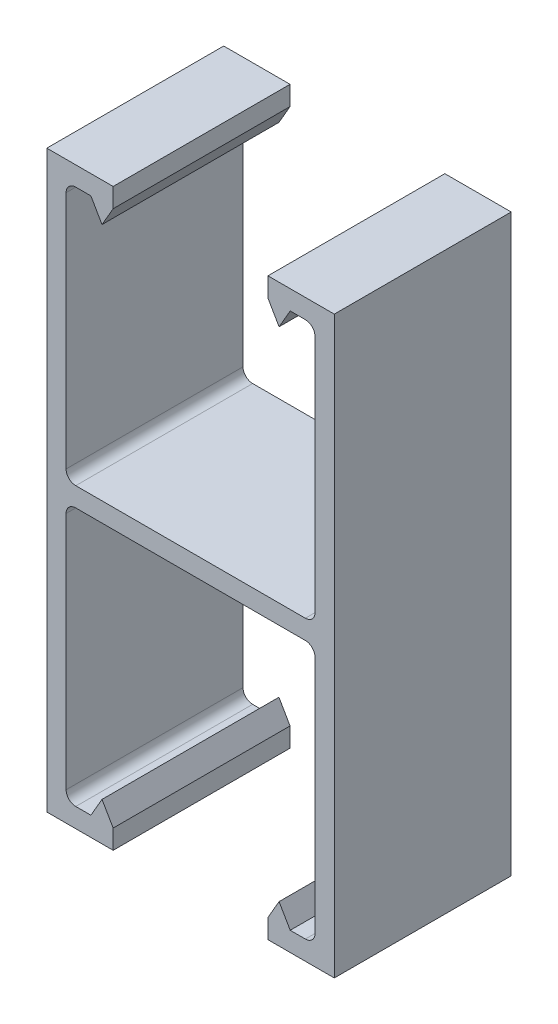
from build123d import *

# Parameters (mm, degrees)
BASE_EXTRUDE_DEPTH = 12.7


with BuildPart() as part:
    # Sketch1 → Base-Extrude (new, symmetric)
    with BuildSketch(Plane.XY):
        with BuildLine():
            Line((-11.1125, 41.275), (-20.6375, 41.275))
            Line((-20.6375, 41.275), (-20.6375, -41.275))
            Line((-20.6375, -41.275), (-11.1125, -41.275))
            Line((-11.1125, -41.275), (-11.1125, -38.5064))
            Line((-11.1125, -38.5064), (-12.710951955, -35.7378))
            Line((-12.710951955, -35.7378), (-14.309403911, -38.5064))
            Line((-14.309403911, -38.5064), (-16.4846, -38.5064))
            ThreePointArc((-16.4846, -38.5064), (-17.463447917, -38.100947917), (-17.8689, -37.1221))
            Line((-17.8689, -37.1221), (-17.8689, -2.7686))
            ThreePointArc((-17.8689, -2.7686), (-17.463447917, -1.789752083), (-16.4846, -1.3843))
            Line((-16.4846, -1.3843), (16.4846, -1.3843))
            ThreePointArc((16.4846, -1.3843), (17.463447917, -1.789752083), (17.8689, -2.7686))
            Line((17.8689, -2.7686), (17.8689, -37.1221))
            ThreePointArc((17.8689, -37.1221), (17.463447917, -38.100947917), (16.4846, -38.5064))
            Line((16.4846, -38.5064), (14.309403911, -38.5064))
            Line((14.309403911, -38.5064), (12.710951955, -35.7378))
            Line((12.710951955, -35.7378), (11.1125, -38.5064))
            Line((11.1125, -38.5064), (11.1125, -41.275))
            Line((11.1125, -41.275), (20.6375, -41.275))
            Line((20.6375, -41.275), (20.6375, 41.275))
            Line((20.6375, 41.275), (11.1125, 41.275))
            Line((11.1125, 41.275), (11.1125, 38.5064))
            Line((11.1125, 38.5064), (12.710951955, 35.7378))
            Line((12.710951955, 35.7378), (14.309403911, 38.5064))
            Line((14.309403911, 38.5064), (16.4846, 38.5064))
            ThreePointArc((16.4846, 38.5064), (17.463447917, 38.100947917), (17.8689, 37.1221))
            Line((17.8689, 37.1221), (17.8689, 2.7686))
            ThreePointArc((17.8689, 2.7686), (17.463447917, 1.789752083), (16.4846, 1.3843))
            Line((16.4846, 1.3843), (-16.4846, 1.3843))
            ThreePointArc((-16.4846, 1.3843), (-17.463447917, 1.789752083), (-17.8689, 2.7686))
            Line((-17.8689, 2.7686), (-17.8689, 37.1221))
            ThreePointArc((-17.8689, 37.1221), (-17.463447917, 38.100947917), (-16.4846, 38.5064))
            Line((-16.4846, 38.5064), (-14.309403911, 38.5064))
            Line((-14.309403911, 38.5064), (-12.710951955, 35.7378))
            Line((-12.710951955, 35.7378), (-11.1125, 38.5064))
            Line((-11.1125, 38.5064), (-11.1125, 41.275))
        make_face()
    extrude(amount=BASE_EXTRUDE_DEPTH, both=True)


solid = part.part
